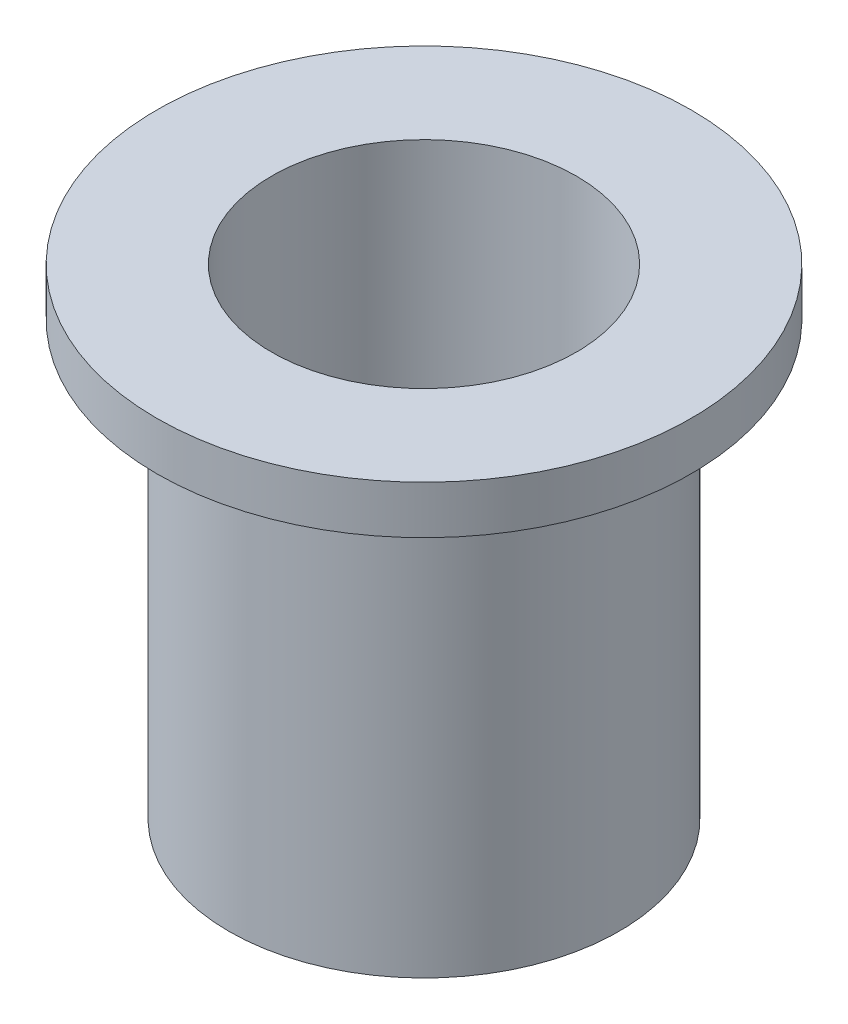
from build123d import *


with BuildPart() as part:
    # Sketch1 → Revolve1 (revolve)
    with BuildSketch(Plane(origin=(0, 0, 0), x_dir=(0, 0, -1), z_dir=(1, 0, 0))):
        Polygon((3.175, 1), (3.175, -9), (4.0625, -9), (4.0625, 0), (5.5625, 0), (5.5625, 1), align=None)
    revolve(axis=Axis((0, 0, 0), (0, 1, 0)))


solid = part.part
